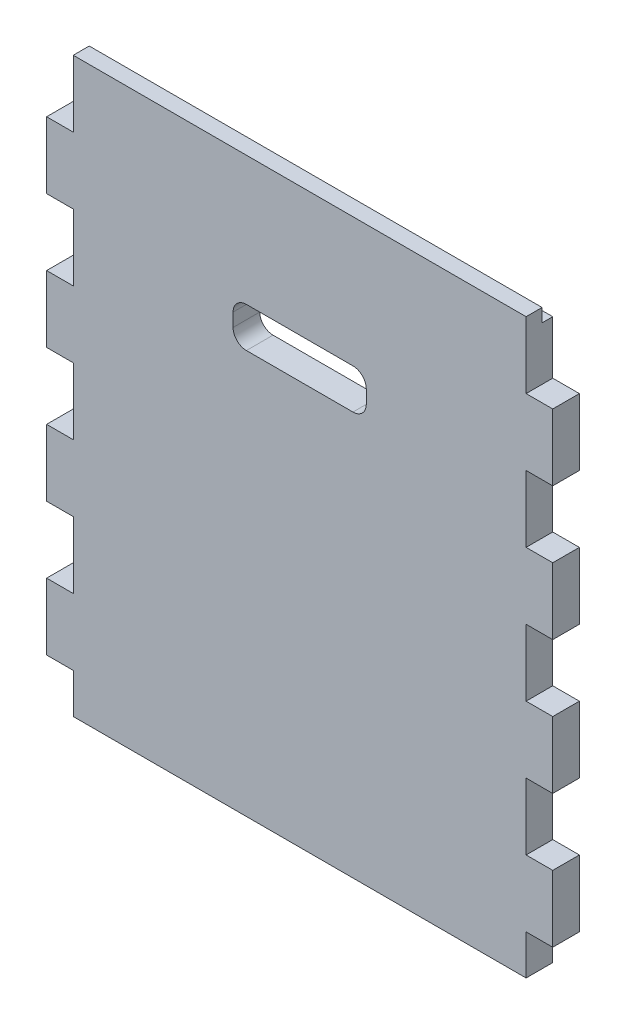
from build123d import *

# Parameters (mm, degrees)
EXTRUDE1_DEPTH = 20
EXTRUDE2_DEPTH = 590.321643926
SKETCH4_W      = 340
SKETCH4_H      = 10
EXTRUDE4_DEPTH = 8


with BuildPart() as part:
    # Sketch1 → Extrude1 (new body)
    with BuildSketch(Plane.XY):
        Polygon((0, 50), (20, 50), (20, 20), (360, 20), (360, 50), (380, 50), (380, 100), (360, 100), (360, 150), (380, 150), (380, 200), (360, 200), (360, 250), (380, 250), (380, 300), (360, 300), (360, 350), (380, 350), (380, 400), (360, 400), (360, 450), (20, 450), (20, 400), (0, 400), (0, 350), (20, 350), (20, 300), (0, 300), (0, 250), (20, 250), (20, 200), (0, 200), (0, 150), (20, 150), (20, 100), (0, 100), align=None)
    extrude(amount=EXTRUDE1_DEPTH)

    # Sketch2 → Extrude2 (cut, through all)
    with BuildSketch(Plane.XY.offset(20)):
        with BuildLine():
            Line((150, 353), (230, 353))
            ThreePointArc((230, 353), (237.071067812, 350.071067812), (240, 343))
            Line((240, 343), (240, 333))
            ThreePointArc((240, 333), (237.071067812, 325.928932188), (230, 323))
            Line((230, 323), (150, 323))
            ThreePointArc((150, 323), (142.928932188, 325.928932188), (140, 333))
            Line((140, 333), (140, 343))
            ThreePointArc((140, 343), (142.928932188, 350.071067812), (150, 353))
        make_face()
    extrude(amount=-EXTRUDE2_DEPTH, mode=Mode.SUBTRACT)

    # Sketch4 → Extrude4 (cut)
    with BuildSketch(Plane(origin=(0, 0, 0), x_dir=(-1, 0, 0), z_dir=(0, 0, -1))):
        with Locations((-190, 445)):
            Rectangle(SKETCH4_W, SKETCH4_H)
    extrude(amount=-EXTRUDE4_DEPTH, mode=Mode.SUBTRACT)


solid = part.part
